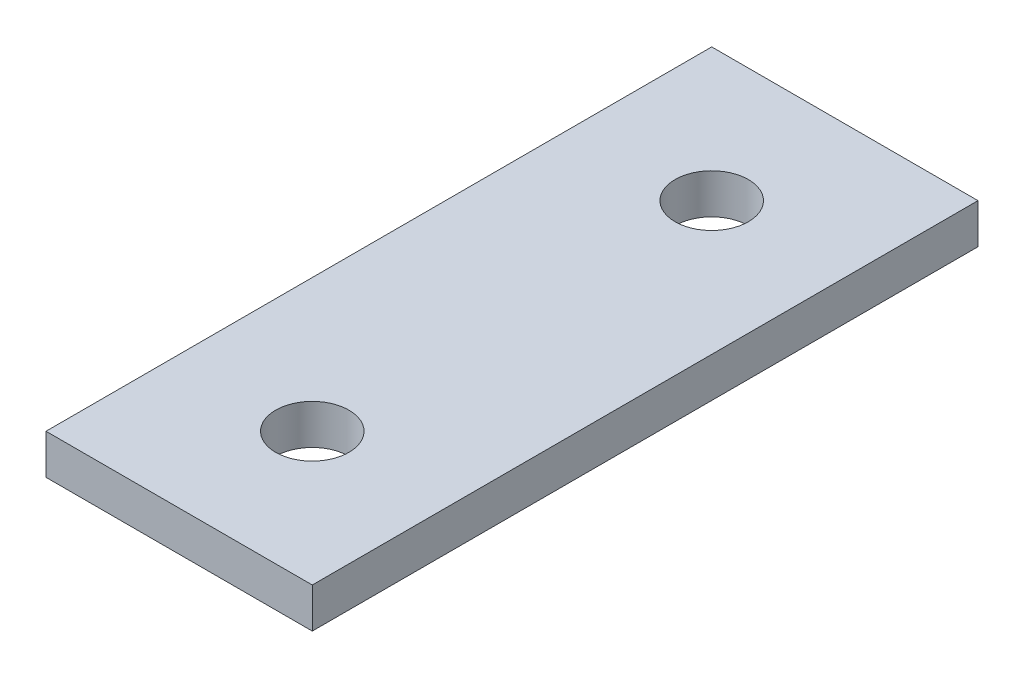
ISO-10303-21;
HEADER;
FILE_DESCRIPTION(('STEP AP214'),'2;1');
FILE_NAME('part.step','',(''),(''),'','','');
FILE_SCHEMA(('AUTOMOTIVE_DESIGN { 1 0 10303 214 1 1 1 1 }'));
ENDSEC;
DATA;
#1=APPLICATION_CONTEXT('core data for automotive mechanical design processes');
#2=APPLICATION_PROTOCOL_DEFINITION('international standard','automotive_design',2000,#1);
#3=PRODUCT_CONTEXT('',#1,'mechanical');
#4=PRODUCT('Part','Part','',(#3));
#5=PRODUCT_RELATED_PRODUCT_CATEGORY('part','',(#4));
#6=PRODUCT_DEFINITION_FORMATION('','',#4);
#7=PRODUCT_DEFINITION_CONTEXT('part definition',#1,'design');
#8=PRODUCT_DEFINITION('design','',#6,#7);
#9=PRODUCT_DEFINITION_SHAPE('','',#8);
#10=(LENGTH_UNIT() NAMED_UNIT(*) SI_UNIT(.MILLI.,.METRE.));
#11=(NAMED_UNIT(*) PLANE_ANGLE_UNIT() SI_UNIT($,.RADIAN.));
#12=(NAMED_UNIT(*) SI_UNIT($,.STERADIAN.) SOLID_ANGLE_UNIT());
#13=UNCERTAINTY_MEASURE_WITH_UNIT(LENGTH_MEASURE(1.E-05),#10,'distance_accuracy_value','');
#14=(GEOMETRIC_REPRESENTATION_CONTEXT(3) GLOBAL_UNCERTAINTY_ASSIGNED_CONTEXT((#13)) GLOBAL_UNIT_ASSIGNED_CONTEXT((#10,
#11,#12)) REPRESENTATION_CONTEXT('',''));
#15=CARTESIAN_POINT('',(0.,0.,0.));
#16=DIRECTION('',(0.,0.,1.));
#17=DIRECTION('',(1.,0.,0.));
#18=AXIS2_PLACEMENT_3D('',#15,#16,#17);
#19=CARTESIAN_POINT('',(0.,3.,-50.));
#20=DIRECTION('',(0.,-1.,0.));
#21=DIRECTION('',(0.,0.,-1.));
#22=AXIS2_PLACEMENT_3D('',#19,#20,#21);
#23=PLANE('',#22);
#24=CARTESIAN_POINT('',(10.,3.,-40.));
#25=DIRECTION('',(0.,1.,0.));
#26=DIRECTION('',(0.,0.,1.));
#27=AXIS2_PLACEMENT_3D('',#24,#25,#26);
#28=CIRCLE('',#27,2.75);
#29=CARTESIAN_POINT('',(10.,3.,-37.25));
#30=VERTEX_POINT('',#29);
#31=EDGE_CURVE('E89',#30,#30,#28,.T.);
#32=ORIENTED_EDGE('',*,*,#31,.F.);
#33=EDGE_LOOP('',(#32));
#34=FACE_BOUND('',#33,.T.);
#35=DIRECTION('',(0.,0.,1.));
#36=VECTOR('',#35,1.);
#37=CARTESIAN_POINT('',(0.,3.,0.));
#38=LINE('',#37,#36);
#39=CARTESIAN_POINT('',(0.,3.,-50.));
#40=VERTEX_POINT('',#39);
#41=CARTESIAN_POINT('',(0.,3.,0.));
#42=VERTEX_POINT('',#41);
#43=EDGE_CURVE('E99',#40,#42,#38,.T.);
#44=ORIENTED_EDGE('',*,*,#43,.T.);
#45=DIRECTION('',(1.,0.,0.));
#46=VECTOR('',#45,1.);
#47=CARTESIAN_POINT('',(0.,3.,0.));
#48=LINE('',#47,#46);
#49=CARTESIAN_POINT('',(20.,3.,0.));
#50=VERTEX_POINT('',#49);
#51=EDGE_CURVE('E84',#42,#50,#48,.T.);
#52=ORIENTED_EDGE('',*,*,#51,.T.);
#53=DIRECTION('',(0.,0.,-1.));
#54=VECTOR('',#53,1.);
#55=CARTESIAN_POINT('',(20.,3.,0.));
#56=LINE('',#55,#54);
#57=CARTESIAN_POINT('',(20.,3.,-50.));
#58=VERTEX_POINT('',#57);
#59=EDGE_CURVE('E50',#50,#58,#56,.T.);
#60=ORIENTED_EDGE('',*,*,#59,.T.);
#61=DIRECTION('',(-1.,0.,0.));
#62=VECTOR('',#61,1.);
#63=CARTESIAN_POINT('',(0.,3.,-50.));
#64=LINE('',#63,#62);
#65=EDGE_CURVE('E45',#58,#40,#64,.T.);
#66=ORIENTED_EDGE('',*,*,#65,.T.);
#67=EDGE_LOOP('',(#44,#52,#60,#66));
#68=FACE_BOUND('',#67,.T.);
#69=CARTESIAN_POINT('',(10.,3.,-10.));
#70=DIRECTION('',(0.,1.,0.));
#71=DIRECTION('',(0.,0.,1.));
#72=AXIS2_PLACEMENT_3D('',#69,#70,#71);
#73=CIRCLE('',#72,2.75);
#74=CARTESIAN_POINT('',(10.,3.,-7.25));
#75=VERTEX_POINT('',#74);
#76=EDGE_CURVE('E117',#75,#75,#73,.T.);
#77=ORIENTED_EDGE('',*,*,#76,.F.);
#78=EDGE_LOOP('',(#77));
#79=FACE_BOUND('',#78,.T.);
#80=ADVANCED_FACE('F30',(#34,#68,#79),#23,.F.);
#81=CARTESIAN_POINT('',(0.,0.,-50.));
#82=DIRECTION('',(0.,-1.,0.));
#83=DIRECTION('',(0.,0.,-1.));
#84=AXIS2_PLACEMENT_3D('',#81,#82,#83);
#85=PLANE('',#84);
#86=CARTESIAN_POINT('',(10.,0.,-40.));
#87=DIRECTION('',(0.,1.,0.));
#88=DIRECTION('',(0.,0.,1.));
#89=AXIS2_PLACEMENT_3D('',#86,#87,#88);
#90=CIRCLE('',#89,2.75);
#91=CARTESIAN_POINT('',(10.,0.,-37.25));
#92=VERTEX_POINT('',#91);
#93=EDGE_CURVE('E92',#92,#92,#90,.T.);
#94=ORIENTED_EDGE('',*,*,#93,.T.);
#95=EDGE_LOOP('',(#94));
#96=FACE_BOUND('',#95,.T.);
#97=DIRECTION('',(0.,0.,1.));
#98=VECTOR('',#97,1.);
#99=CARTESIAN_POINT('',(0.,0.,0.));
#100=LINE('',#99,#98);
#101=CARTESIAN_POINT('',(0.,0.,-50.));
#102=VERTEX_POINT('',#101);
#103=CARTESIAN_POINT('',(0.,0.,0.));
#104=VERTEX_POINT('',#103);
#105=EDGE_CURVE('E76',#102,#104,#100,.T.);
#106=ORIENTED_EDGE('',*,*,#105,.F.);
#107=DIRECTION('',(-1.,0.,0.));
#108=VECTOR('',#107,1.);
#109=CARTESIAN_POINT('',(0.,0.,-50.));
#110=LINE('',#109,#108);
#111=CARTESIAN_POINT('',(20.,0.,-50.));
#112=VERTEX_POINT('',#111);
#113=EDGE_CURVE('E97',#112,#102,#110,.T.);
#114=ORIENTED_EDGE('',*,*,#113,.F.);
#115=DIRECTION('',(0.,0.,-1.));
#116=VECTOR('',#115,1.);
#117=CARTESIAN_POINT('',(20.,0.,0.));
#118=LINE('',#117,#116);
#119=CARTESIAN_POINT('',(20.,0.,0.));
#120=VERTEX_POINT('',#119);
#121=EDGE_CURVE('E77',#120,#112,#118,.T.);
#122=ORIENTED_EDGE('',*,*,#121,.F.);
#123=DIRECTION('',(1.,0.,0.));
#124=VECTOR('',#123,1.);
#125=CARTESIAN_POINT('',(0.,0.,0.));
#126=LINE('',#125,#124);
#127=EDGE_CURVE('E71',#104,#120,#126,.T.);
#128=ORIENTED_EDGE('',*,*,#127,.F.);
#129=EDGE_LOOP('',(#106,#114,#122,#128));
#130=FACE_BOUND('',#129,.T.);
#131=CARTESIAN_POINT('',(10.,0.,-10.));
#132=DIRECTION('',(0.,1.,0.));
#133=DIRECTION('',(0.,0.,1.));
#134=AXIS2_PLACEMENT_3D('',#131,#132,#133);
#135=CIRCLE('',#134,2.75);
#136=CARTESIAN_POINT('',(10.,0.,-7.25));
#137=VERTEX_POINT('',#136);
#138=EDGE_CURVE('E119',#137,#137,#135,.T.);
#139=ORIENTED_EDGE('',*,*,#138,.T.);
#140=EDGE_LOOP('',(#139));
#141=FACE_BOUND('',#140,.T.);
#142=ADVANCED_FACE('F72',(#96,#130,#141),#85,.T.);
#143=CARTESIAN_POINT('',(0.,3.,0.));
#144=DIRECTION('',(1.,0.,0.));
#145=DIRECTION('',(0.,0.,-1.));
#146=AXIS2_PLACEMENT_3D('',#143,#144,#145);
#147=PLANE('',#146);
#148=ORIENTED_EDGE('',*,*,#105,.T.);
#149=DIRECTION('',(0.,-1.,0.));
#150=VECTOR('',#149,1.);
#151=CARTESIAN_POINT('',(0.,3.,0.));
#152=LINE('',#151,#150);
#153=EDGE_CURVE('E11',#42,#104,#152,.T.);
#154=ORIENTED_EDGE('',*,*,#153,.F.);
#155=ORIENTED_EDGE('',*,*,#43,.F.);
#156=DIRECTION('',(0.,-1.,0.));
#157=VECTOR('',#156,1.);
#158=CARTESIAN_POINT('',(0.,3.,-50.));
#159=LINE('',#158,#157);
#160=EDGE_CURVE('E88',#40,#102,#159,.T.);
#161=ORIENTED_EDGE('',*,*,#160,.T.);
#162=EDGE_LOOP('',(#148,#154,#155,#161));
#163=FACE_BOUND('',#162,.T.);
#164=ADVANCED_FACE('F32',(#163),#147,.F.);
#165=CARTESIAN_POINT('',(0.,3.,0.));
#166=DIRECTION('',(0.,0.,-1.));
#167=DIRECTION('',(-1.,0.,0.));
#168=AXIS2_PLACEMENT_3D('',#165,#166,#167);
#169=PLANE('',#168);
#170=ORIENTED_EDGE('',*,*,#127,.T.);
#171=DIRECTION('',(0.,-1.,0.));
#172=VECTOR('',#171,1.);
#173=CARTESIAN_POINT('',(20.,3.,0.));
#174=LINE('',#173,#172);
#175=EDGE_CURVE('E38',#50,#120,#174,.T.);
#176=ORIENTED_EDGE('',*,*,#175,.F.);
#177=ORIENTED_EDGE('',*,*,#51,.F.);
#178=ORIENTED_EDGE('',*,*,#153,.T.);
#179=EDGE_LOOP('',(#170,#176,#177,#178));
#180=FACE_BOUND('',#179,.T.);
#181=ADVANCED_FACE('F83',(#180),#169,.F.);
#182=CARTESIAN_POINT('',(20.,3.,0.));
#183=DIRECTION('',(-1.,0.,0.));
#184=DIRECTION('',(0.,0.,1.));
#185=AXIS2_PLACEMENT_3D('',#182,#183,#184);
#186=PLANE('',#185);
#187=ORIENTED_EDGE('',*,*,#121,.T.);
#188=DIRECTION('',(0.,-1.,0.));
#189=VECTOR('',#188,1.);
#190=CARTESIAN_POINT('',(20.,3.,-50.));
#191=LINE('',#190,#189);
#192=EDGE_CURVE('E105',#58,#112,#191,.T.);
#193=ORIENTED_EDGE('',*,*,#192,.F.);
#194=ORIENTED_EDGE('',*,*,#59,.F.);
#195=ORIENTED_EDGE('',*,*,#175,.T.);
#196=EDGE_LOOP('',(#187,#193,#194,#195));
#197=FACE_BOUND('',#196,.T.);
#198=ADVANCED_FACE('F108',(#197),#186,.F.);
#199=CARTESIAN_POINT('',(0.,3.,-50.));
#200=DIRECTION('',(0.,0.,1.));
#201=DIRECTION('',(1.,0.,0.));
#202=AXIS2_PLACEMENT_3D('',#199,#200,#201);
#203=PLANE('',#202);
#204=ORIENTED_EDGE('',*,*,#113,.T.);
#205=ORIENTED_EDGE('',*,*,#160,.F.);
#206=ORIENTED_EDGE('',*,*,#65,.F.);
#207=ORIENTED_EDGE('',*,*,#192,.T.);
#208=EDGE_LOOP('',(#204,#205,#206,#207));
#209=FACE_BOUND('',#208,.T.);
#210=ADVANCED_FACE('F110',(#209),#203,.F.);
#211=CARTESIAN_POINT('',(10.,3.,-40.));
#212=DIRECTION('',(0.,-1.,0.));
#213=DIRECTION('',(0.,0.,-1.));
#214=AXIS2_PLACEMENT_3D('',#211,#212,#213);
#215=CYLINDRICAL_SURFACE('',#214,2.75);
#216=ORIENTED_EDGE('',*,*,#31,.T.);
#217=EDGE_LOOP('',(#216));
#218=FACE_BOUND('',#217,.T.);
#219=ORIENTED_EDGE('',*,*,#93,.F.);
#220=EDGE_LOOP('',(#219));
#221=FACE_BOUND('',#220,.T.);
#222=ADVANCED_FACE('F128',(#218,#221),#215,.F.);
#223=CARTESIAN_POINT('',(10.,3.,-10.));
#224=DIRECTION('',(0.,-1.,0.));
#225=DIRECTION('',(0.,0.,-1.));
#226=AXIS2_PLACEMENT_3D('',#223,#224,#225);
#227=CYLINDRICAL_SURFACE('',#226,2.75);
#228=ORIENTED_EDGE('',*,*,#76,.T.);
#229=EDGE_LOOP('',(#228));
#230=FACE_BOUND('',#229,.T.);
#231=ORIENTED_EDGE('',*,*,#138,.F.);
#232=EDGE_LOOP('',(#231));
#233=FACE_BOUND('',#232,.T.);
#234=ADVANCED_FACE('F126',(#230,#233),#227,.F.);
#235=CLOSED_SHELL('',(#80,#142,#164,#181,#198,#210,#222,#234));
#236=MANIFOLD_SOLID_BREP('B2',#235);
#237=ADVANCED_BREP_SHAPE_REPRESENTATION('',(#18,#236),#14);
#238=SHAPE_DEFINITION_REPRESENTATION(#9,#237);
ENDSEC;
END-ISO-10303-21;
